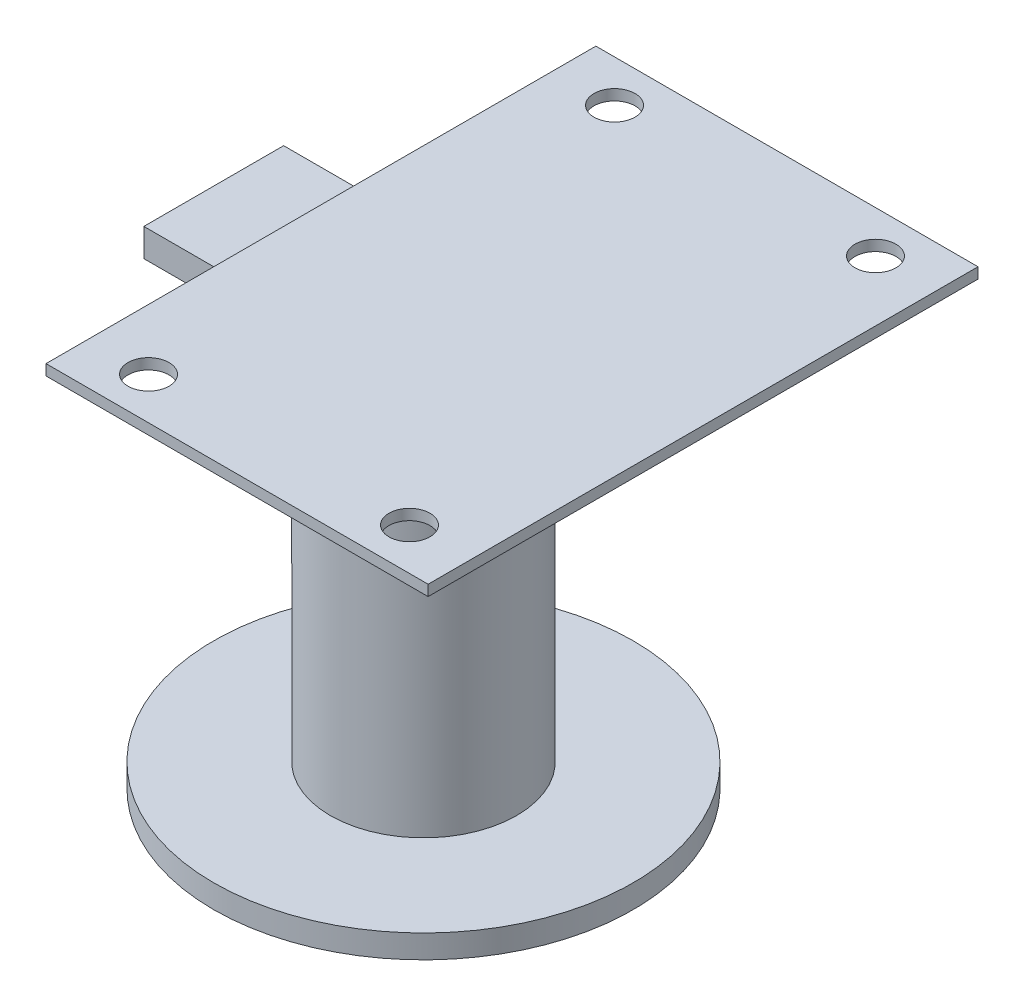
ISO-10303-21;
HEADER;
FILE_DESCRIPTION(('STEP AP214'),'2;1');
FILE_NAME('part.step','',(''),(''),'','','');
FILE_SCHEMA(('AUTOMOTIVE_DESIGN { 1 0 10303 214 1 1 1 1 }'));
ENDSEC;
DATA;
#1=APPLICATION_CONTEXT('core data for automotive mechanical design processes');
#2=APPLICATION_PROTOCOL_DEFINITION('international standard','automotive_design',2000,#1);
#3=PRODUCT_CONTEXT('',#1,'mechanical');
#4=PRODUCT('Part','Part','',(#3));
#5=PRODUCT_RELATED_PRODUCT_CATEGORY('part','',(#4));
#6=PRODUCT_DEFINITION_FORMATION('','',#4);
#7=PRODUCT_DEFINITION_CONTEXT('part definition',#1,'design');
#8=PRODUCT_DEFINITION('design','',#6,#7);
#9=PRODUCT_DEFINITION_SHAPE('','',#8);
#10=(LENGTH_UNIT() NAMED_UNIT(*) SI_UNIT(.MILLI.,.METRE.));
#11=(NAMED_UNIT(*) PLANE_ANGLE_UNIT() SI_UNIT($,.RADIAN.));
#12=(NAMED_UNIT(*) SI_UNIT($,.STERADIAN.) SOLID_ANGLE_UNIT());
#13=UNCERTAINTY_MEASURE_WITH_UNIT(LENGTH_MEASURE(1.E-05),#10,'distance_accuracy_value','');
#14=(GEOMETRIC_REPRESENTATION_CONTEXT(3) GLOBAL_UNCERTAINTY_ASSIGNED_CONTEXT((#13)) GLOBAL_UNIT_ASSIGNED_CONTEXT((#10,
#11,#12)) REPRESENTATION_CONTEXT('',''));
#15=CARTESIAN_POINT('',(0.,0.,0.));
#16=DIRECTION('',(0.,0.,1.));
#17=DIRECTION('',(1.,0.,0.));
#18=AXIS2_PLACEMENT_3D('',#15,#16,#17);
#19=CARTESIAN_POINT('',(41.,-2.3,59.));
#20=DIRECTION('',(1.,0.,0.));
#21=DIRECTION('',(0.,0.,-1.));
#22=AXIS2_PLACEMENT_3D('',#19,#20,#21);
#23=PLANE('',#22);
#24=DIRECTION('',(0.,0.,-1.));
#25=VECTOR('',#24,1.);
#26=CARTESIAN_POINT('',(41.,0.,59.));
#27=LINE('',#26,#25);
#28=CARTESIAN_POINT('',(41.,0.,59.));
#29=VERTEX_POINT('',#28);
#30=CARTESIAN_POINT('',(41.,0.,-59.));
#31=VERTEX_POINT('',#30);
#32=EDGE_CURVE('E186',#29,#31,#27,.T.);
#33=ORIENTED_EDGE('',*,*,#32,.F.);
#34=DIRECTION('',(0.,1.,0.));
#35=VECTOR('',#34,1.);
#36=CARTESIAN_POINT('',(41.,-2.3,59.));
#37=LINE('',#36,#35);
#38=CARTESIAN_POINT('',(41.,-2.3,59.));
#39=VERTEX_POINT('',#38);
#40=EDGE_CURVE('E174',#39,#29,#37,.T.);
#41=ORIENTED_EDGE('',*,*,#40,.F.);
#42=DIRECTION('',(0.,0.,-1.));
#43=VECTOR('',#42,1.);
#44=CARTESIAN_POINT('',(41.,-2.3,59.));
#45=LINE('',#44,#43);
#46=CARTESIAN_POINT('',(41.,-2.3,-59.));
#47=VERTEX_POINT('',#46);
#48=EDGE_CURVE('E169',#39,#47,#45,.T.);
#49=ORIENTED_EDGE('',*,*,#48,.T.);
#50=DIRECTION('',(0.,1.,0.));
#51=VECTOR('',#50,1.);
#52=CARTESIAN_POINT('',(41.,-2.3,-59.));
#53=LINE('',#52,#51);
#54=EDGE_CURVE('E151',#47,#31,#53,.T.);
#55=ORIENTED_EDGE('',*,*,#54,.T.);
#56=EDGE_LOOP('',(#33,#41,#49,#55));
#57=FACE_BOUND('',#56,.T.);
#58=ADVANCED_FACE('F40',(#57),#23,.T.);
#59=CARTESIAN_POINT('',(-41.,-2.3,59.));
#60=DIRECTION('',(0.,0.,1.));
#61=DIRECTION('',(1.,0.,0.));
#62=AXIS2_PLACEMENT_3D('',#59,#60,#61);
#63=PLANE('',#62);
#64=DIRECTION('',(1.,0.,0.));
#65=VECTOR('',#64,1.);
#66=CARTESIAN_POINT('',(-41.,0.,59.));
#67=LINE('',#66,#65);
#68=CARTESIAN_POINT('',(-41.,0.,59.));
#69=VERTEX_POINT('',#68);
#70=EDGE_CURVE('E175',#69,#29,#67,.T.);
#71=ORIENTED_EDGE('',*,*,#70,.F.);
#72=DIRECTION('',(0.,1.,0.));
#73=VECTOR('',#72,1.);
#74=CARTESIAN_POINT('',(-41.,-2.3,59.));
#75=LINE('',#74,#73);
#76=CARTESIAN_POINT('',(-41.,-2.3,59.));
#77=VERTEX_POINT('',#76);
#78=EDGE_CURVE('E193',#77,#69,#75,.T.);
#79=ORIENTED_EDGE('',*,*,#78,.F.);
#80=DIRECTION('',(1.,0.,0.));
#81=VECTOR('',#80,1.);
#82=CARTESIAN_POINT('',(-41.,-2.3,59.));
#83=LINE('',#82,#81);
#84=EDGE_CURVE('E162',#77,#39,#83,.T.);
#85=ORIENTED_EDGE('',*,*,#84,.T.);
#86=ORIENTED_EDGE('',*,*,#40,.T.);
#87=EDGE_LOOP('',(#71,#79,#85,#86));
#88=FACE_BOUND('',#87,.T.);
#89=ADVANCED_FACE('F308',(#88),#63,.T.);
#90=CARTESIAN_POINT('',(-41.,-2.3,59.));
#91=DIRECTION('',(-1.,0.,0.));
#92=DIRECTION('',(0.,0.,1.));
#93=AXIS2_PLACEMENT_3D('',#90,#91,#92);
#94=PLANE('',#93);
#95=DIRECTION('',(0.,0.,1.));
#96=VECTOR('',#95,1.);
#97=CARTESIAN_POINT('',(-41.,0.,59.));
#98=LINE('',#97,#96);
#99=CARTESIAN_POINT('',(-41.,0.,-59.));
#100=VERTEX_POINT('',#99);
#101=EDGE_CURVE('E178',#100,#69,#98,.T.);
#102=ORIENTED_EDGE('',*,*,#101,.F.);
#103=DIRECTION('',(0.,1.,0.));
#104=VECTOR('',#103,1.);
#105=CARTESIAN_POINT('',(-41.,-2.3,-59.));
#106=LINE('',#105,#104);
#107=CARTESIAN_POINT('',(-41.,-2.3,-59.));
#108=VERTEX_POINT('',#107);
#109=EDGE_CURVE('E161',#108,#100,#106,.T.);
#110=ORIENTED_EDGE('',*,*,#109,.F.);
#111=DIRECTION('',(0.,0.,1.));
#112=VECTOR('',#111,1.);
#113=CARTESIAN_POINT('',(-41.,-2.3,59.));
#114=LINE('',#113,#112);
#115=EDGE_CURVE('E172',#108,#77,#114,.T.);
#116=ORIENTED_EDGE('',*,*,#115,.T.);
#117=ORIENTED_EDGE('',*,*,#78,.T.);
#118=EDGE_LOOP('',(#102,#110,#116,#117));
#119=FACE_BOUND('',#118,.T.);
#120=ADVANCED_FACE('F313',(#119),#94,.T.);
#121=CARTESIAN_POINT('',(-41.,-2.3,-59.));
#122=DIRECTION('',(0.,0.,-1.));
#123=DIRECTION('',(-1.,0.,0.));
#124=AXIS2_PLACEMENT_3D('',#121,#122,#123);
#125=PLANE('',#124);
#126=DIRECTION('',(-1.,0.,0.));
#127=VECTOR('',#126,1.);
#128=CARTESIAN_POINT('',(-41.,0.,-59.));
#129=LINE('',#128,#127);
#130=EDGE_CURVE('E156',#31,#100,#129,.T.);
#131=ORIENTED_EDGE('',*,*,#130,.F.);
#132=ORIENTED_EDGE('',*,*,#54,.F.);
#133=DIRECTION('',(-1.,0.,0.));
#134=VECTOR('',#133,1.);
#135=CARTESIAN_POINT('',(-41.,-2.3,-59.));
#136=LINE('',#135,#134);
#137=EDGE_CURVE('E154',#47,#108,#136,.T.);
#138=ORIENTED_EDGE('',*,*,#137,.T.);
#139=ORIENTED_EDGE('',*,*,#109,.T.);
#140=EDGE_LOOP('',(#131,#132,#138,#139));
#141=FACE_BOUND('',#140,.T.);
#142=ADVANCED_FACE('F153',(#141),#125,.T.);
#143=CARTESIAN_POINT('',(0.,-2.3,0.));
#144=DIRECTION('',(0.,-1.,0.));
#145=DIRECTION('',(0.,0.,-1.));
#146=AXIS2_PLACEMENT_3D('',#143,#144,#145);
#147=PLANE('',#146);
#148=CARTESIAN_POINT('',(-19.,-2.3,0.));
#149=DIRECTION('',(0.,-1.,0.));
#150=DIRECTION('',(0.,0.,-1.));
#151=AXIS2_PLACEMENT_3D('',#148,#149,#150);
#152=CIRCLE('',#151,20.);
#153=CARTESIAN_POINT('',(-19.,-2.3,-20.));
#154=VERTEX_POINT('',#153);
#155=EDGE_CURVE('E539',#154,#154,#152,.T.);
#156=ORIENTED_EDGE('',*,*,#155,.F.);
#157=EDGE_LOOP('',(#156));
#158=FACE_BOUND('',#157,.T.);
#159=CARTESIAN_POINT('',(28.,-2.3,-50.));
#160=DIRECTION('',(0.,1.,0.));
#161=DIRECTION('',(0.,0.,1.));
#162=AXIS2_PLACEMENT_3D('',#159,#160,#161);
#163=CIRCLE('',#162,4.4);
#164=CARTESIAN_POINT('',(28.,-2.3,-45.6));
#165=VERTEX_POINT('',#164);
#166=EDGE_CURVE('E543',#165,#165,#163,.T.);
#167=ORIENTED_EDGE('',*,*,#166,.T.);
#168=EDGE_LOOP('',(#167));
#169=FACE_BOUND('',#168,.T.);
#170=CARTESIAN_POINT('',(28.,-2.3,50.));
#171=DIRECTION('',(0.,1.,0.));
#172=DIRECTION('',(0.,0.,1.));
#173=AXIS2_PLACEMENT_3D('',#170,#171,#172);
#174=CIRCLE('',#173,4.4);
#175=CARTESIAN_POINT('',(28.,-2.3,54.4));
#176=VERTEX_POINT('',#175);
#177=EDGE_CURVE('E547',#176,#176,#174,.T.);
#178=ORIENTED_EDGE('',*,*,#177,.T.);
#179=EDGE_LOOP('',(#178));
#180=FACE_BOUND('',#179,.T.);
#181=CARTESIAN_POINT('',(-28.,-2.3,50.));
#182=DIRECTION('',(0.,1.,0.));
#183=DIRECTION('',(0.,0.,1.));
#184=AXIS2_PLACEMENT_3D('',#181,#182,#183);
#185=CIRCLE('',#184,4.4);
#186=CARTESIAN_POINT('',(-28.,-2.3,54.4));
#187=VERTEX_POINT('',#186);
#188=EDGE_CURVE('E551',#187,#187,#185,.T.);
#189=ORIENTED_EDGE('',*,*,#188,.T.);
#190=EDGE_LOOP('',(#189));
#191=FACE_BOUND('',#190,.T.);
#192=CARTESIAN_POINT('',(-28.,-2.3,-50.));
#193=DIRECTION('',(0.,1.,0.));
#194=DIRECTION('',(0.,0.,1.));
#195=AXIS2_PLACEMENT_3D('',#192,#193,#194);
#196=CIRCLE('',#195,4.4);
#197=CARTESIAN_POINT('',(-28.,-2.3,-45.6));
#198=VERTEX_POINT('',#197);
#199=EDGE_CURVE('E188',#198,#198,#196,.T.);
#200=ORIENTED_EDGE('',*,*,#199,.T.);
#201=EDGE_LOOP('',(#200));
#202=FACE_BOUND('',#201,.T.);
#203=ORIENTED_EDGE('',*,*,#48,.F.);
#204=ORIENTED_EDGE('',*,*,#84,.F.);
#205=ORIENTED_EDGE('',*,*,#115,.F.);
#206=ORIENTED_EDGE('',*,*,#137,.F.);
#207=EDGE_LOOP('',(#203,#204,#205,#206));
#208=FACE_BOUND('',#207,.T.);
#209=ADVANCED_FACE('F167',(#158,#169,#180,#191,#202,#208),#147,.T.);
#210=CARTESIAN_POINT('',(0.,0.,0.));
#211=DIRECTION('',(0.,-1.,0.));
#212=DIRECTION('',(0.,0.,-1.));
#213=AXIS2_PLACEMENT_3D('',#210,#211,#212);
#214=PLANE('',#213);
#215=CARTESIAN_POINT('',(28.,0.,-50.));
#216=DIRECTION('',(0.,1.,0.));
#217=DIRECTION('',(0.,0.,1.));
#218=AXIS2_PLACEMENT_3D('',#215,#216,#217);
#219=CIRCLE('',#218,4.4);
#220=CARTESIAN_POINT('',(28.,0.,-45.6));
#221=VERTEX_POINT('',#220);
#222=EDGE_CURVE('E564',#221,#221,#219,.T.);
#223=ORIENTED_EDGE('',*,*,#222,.F.);
#224=EDGE_LOOP('',(#223));
#225=FACE_BOUND('',#224,.T.);
#226=CARTESIAN_POINT('',(28.,0.,50.));
#227=DIRECTION('',(0.,1.,0.));
#228=DIRECTION('',(0.,0.,1.));
#229=AXIS2_PLACEMENT_3D('',#226,#227,#228);
#230=CIRCLE('',#229,4.4);
#231=CARTESIAN_POINT('',(28.,0.,54.4));
#232=VERTEX_POINT('',#231);
#233=EDGE_CURVE('E560',#232,#232,#230,.T.);
#234=ORIENTED_EDGE('',*,*,#233,.F.);
#235=EDGE_LOOP('',(#234));
#236=FACE_BOUND('',#235,.T.);
#237=CARTESIAN_POINT('',(-28.,0.,50.));
#238=DIRECTION('',(0.,1.,0.));
#239=DIRECTION('',(0.,0.,1.));
#240=AXIS2_PLACEMENT_3D('',#237,#238,#239);
#241=CIRCLE('',#240,4.4);
#242=CARTESIAN_POINT('',(-28.,0.,54.4));
#243=VERTEX_POINT('',#242);
#244=EDGE_CURVE('E556',#243,#243,#241,.T.);
#245=ORIENTED_EDGE('',*,*,#244,.F.);
#246=EDGE_LOOP('',(#245));
#247=FACE_BOUND('',#246,.T.);
#248=CARTESIAN_POINT('',(-28.,0.,-50.));
#249=DIRECTION('',(0.,1.,0.));
#250=DIRECTION('',(0.,0.,1.));
#251=AXIS2_PLACEMENT_3D('',#248,#249,#250);
#252=CIRCLE('',#251,4.4);
#253=CARTESIAN_POINT('',(-28.,0.,-45.6));
#254=VERTEX_POINT('',#253);
#255=EDGE_CURVE('E181',#254,#254,#252,.T.);
#256=ORIENTED_EDGE('',*,*,#255,.F.);
#257=EDGE_LOOP('',(#256));
#258=FACE_BOUND('',#257,.T.);
#259=ORIENTED_EDGE('',*,*,#32,.T.);
#260=ORIENTED_EDGE('',*,*,#130,.T.);
#261=ORIENTED_EDGE('',*,*,#101,.T.);
#262=ORIENTED_EDGE('',*,*,#70,.T.);
#263=EDGE_LOOP('',(#259,#260,#261,#262));
#264=FACE_BOUND('',#263,.T.);
#265=ADVANCED_FACE('F470',(#225,#236,#247,#258,#264),#214,.F.);
#266=CARTESIAN_POINT('',(-28.,-2.3,-50.));
#267=DIRECTION('',(0.,1.,0.));
#268=DIRECTION('',(0.,0.,1.));
#269=AXIS2_PLACEMENT_3D('',#266,#267,#268);
#270=CYLINDRICAL_SURFACE('',#269,4.4);
#271=ORIENTED_EDGE('',*,*,#199,.F.);
#272=EDGE_LOOP('',(#271));
#273=FACE_BOUND('',#272,.T.);
#274=ORIENTED_EDGE('',*,*,#255,.T.);
#275=EDGE_LOOP('',(#274));
#276=FACE_BOUND('',#275,.T.);
#277=ADVANCED_FACE('F460',(#273,#276),#270,.F.);
#278=CARTESIAN_POINT('',(-28.,-2.3,50.));
#279=DIRECTION('',(0.,1.,0.));
#280=DIRECTION('',(0.,0.,1.));
#281=AXIS2_PLACEMENT_3D('',#278,#279,#280);
#282=CYLINDRICAL_SURFACE('',#281,4.4);
#283=ORIENTED_EDGE('',*,*,#188,.F.);
#284=EDGE_LOOP('',(#283));
#285=FACE_BOUND('',#284,.T.);
#286=ORIENTED_EDGE('',*,*,#244,.T.);
#287=EDGE_LOOP('',(#286));
#288=FACE_BOUND('',#287,.T.);
#289=ADVANCED_FACE('F450',(#285,#288),#282,.F.);
#290=CARTESIAN_POINT('',(28.,-2.3,50.));
#291=DIRECTION('',(0.,1.,0.));
#292=DIRECTION('',(0.,0.,1.));
#293=AXIS2_PLACEMENT_3D('',#290,#291,#292);
#294=CYLINDRICAL_SURFACE('',#293,4.4);
#295=ORIENTED_EDGE('',*,*,#177,.F.);
#296=EDGE_LOOP('',(#295));
#297=FACE_BOUND('',#296,.T.);
#298=ORIENTED_EDGE('',*,*,#233,.T.);
#299=EDGE_LOOP('',(#298));
#300=FACE_BOUND('',#299,.T.);
#301=ADVANCED_FACE('F440',(#297,#300),#294,.F.);
#302=CARTESIAN_POINT('',(28.,-2.3,-50.));
#303=DIRECTION('',(0.,1.,0.));
#304=DIRECTION('',(0.,0.,1.));
#305=AXIS2_PLACEMENT_3D('',#302,#303,#304);
#306=CYLINDRICAL_SURFACE('',#305,4.4);
#307=ORIENTED_EDGE('',*,*,#166,.F.);
#308=EDGE_LOOP('',(#307));
#309=FACE_BOUND('',#308,.T.);
#310=ORIENTED_EDGE('',*,*,#222,.T.);
#311=EDGE_LOOP('',(#310));
#312=FACE_BOUND('',#311,.T.);
#313=ADVANCED_FACE('F431',(#309,#312),#306,.F.);
#314=CARTESIAN_POINT('',(-19.,-154.068542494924,0.));
#315=DIRECTION('',(0.,1.,0.));
#316=DIRECTION('',(0.,0.,1.));
#317=AXIS2_PLACEMENT_3D('',#314,#315,#316);
#318=CYLINDRICAL_SURFACE('',#317,20.);
#319=DIRECTION('',(0.,1.,0.));
#320=VECTOR('',#319,1.);
#321=CARTESIAN_POINT('',(-32.228756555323,-154.068542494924,15.));
#322=LINE('',#321,#320);
#323=CARTESIAN_POINT('',(-32.228756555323,-33.0074092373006,15.));
#324=VERTEX_POINT('',#323);
#325=CARTESIAN_POINT('',(-32.228756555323,-8.00000000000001,15.));
#326=VERTEX_POINT('',#325);
#327=EDGE_CURVE('E206',#324,#326,#322,.T.);
#328=ORIENTED_EDGE('',*,*,#327,.F.);
#329=CARTESIAN_POINT('',(-19.,-48.,0.));
#330=DIRECTION('',(0.749837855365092,0.661621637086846,0.));
#331=DIRECTION('',(-0.661621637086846,0.749837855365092,0.));
#332=AXIS2_PLACEMENT_3D('',#329,#330,#331);
#333=ELLIPSE('',#332,30.2287574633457,20.);
#334=CARTESIAN_POINT('',(-33.2828568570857,-31.8127622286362,14.));
#335=VERTEX_POINT('',#334);
#336=EDGE_CURVE('E200',#324,#335,#333,.F.);
#337=ORIENTED_EDGE('',*,*,#336,.T.);
#338=DIRECTION('',(0.,1.,0.));
#339=VECTOR('',#338,1.);
#340=CARTESIAN_POINT('',(-33.2828568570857,-154.068542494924,14.));
#341=LINE('',#340,#339);
#342=CARTESIAN_POINT('',(-33.2828568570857,-9.00000000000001,14.));
#343=VERTEX_POINT('',#342);
#344=EDGE_CURVE('E199',#335,#343,#341,.T.);
#345=ORIENTED_EDGE('',*,*,#344,.T.);
#346=CARTESIAN_POINT('',(-19.,-9.00000000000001,0.));
#347=DIRECTION('',(0.,-1.,0.));
#348=DIRECTION('',(1.,0.,0.));
#349=AXIS2_PLACEMENT_3D('',#346,#347,#348);
#350=CIRCLE('',#349,20.);
#351=CARTESIAN_POINT('',(-33.2828568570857,-9.00000000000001,-14.));
#352=VERTEX_POINT('',#351);
#353=EDGE_CURVE('E55',#352,#343,#350,.F.);
#354=ORIENTED_EDGE('',*,*,#353,.F.);
#355=DIRECTION('',(0.,1.,0.));
#356=VECTOR('',#355,1.);
#357=CARTESIAN_POINT('',(-33.2828568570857,-154.068542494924,-14.));
#358=LINE('',#357,#356);
#359=CARTESIAN_POINT('',(-33.2828568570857,-31.8127622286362,-14.));
#360=VERTEX_POINT('',#359);
#361=EDGE_CURVE('E12',#360,#352,#358,.T.);
#362=ORIENTED_EDGE('',*,*,#361,.F.);
#363=CARTESIAN_POINT('',(-32.228756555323,-33.0074092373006,-15.));
#364=VERTEX_POINT('',#363);
#365=EDGE_CURVE('E197',#360,#364,#333,.F.);
#366=ORIENTED_EDGE('',*,*,#365,.T.);
#367=DIRECTION('',(0.,1.,0.));
#368=VECTOR('',#367,1.);
#369=CARTESIAN_POINT('',(-32.228756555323,-154.068542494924,-15.));
#370=LINE('',#369,#368);
#371=CARTESIAN_POINT('',(-32.228756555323,-8.00000000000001,-15.));
#372=VERTEX_POINT('',#371);
#373=EDGE_CURVE('E202',#364,#372,#370,.T.);
#374=ORIENTED_EDGE('',*,*,#373,.T.);
#375=CARTESIAN_POINT('',(-19.,-8.00000000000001,0.));
#376=DIRECTION('',(0.,-1.,0.));
#377=DIRECTION('',(1.,0.,0.));
#378=AXIS2_PLACEMENT_3D('',#375,#376,#377);
#379=CIRCLE('',#378,20.);
#380=EDGE_CURVE('E204',#372,#326,#379,.F.);
#381=ORIENTED_EDGE('',*,*,#380,.T.);
#382=EDGE_LOOP('',(#328,#337,#345,#354,#362,#366,#374,#381));
#383=FACE_BOUND('',#382,.T.);
#384=CARTESIAN_POINT('',(-19.,-92.5,0.));
#385=DIRECTION('',(0.,-1.,0.));
#386=DIRECTION('',(0.,0.,-1.));
#387=AXIS2_PLACEMENT_3D('',#384,#385,#386);
#388=CIRCLE('',#387,20.);
#389=CARTESIAN_POINT('',(-19.,-92.5,-20.));
#390=VERTEX_POINT('',#389);
#391=EDGE_CURVE('E569',#390,#390,#388,.T.);
#392=ORIENTED_EDGE('',*,*,#391,.F.);
#393=EDGE_LOOP('',(#392));
#394=FACE_BOUND('',#393,.T.);
#395=ORIENTED_EDGE('',*,*,#155,.T.);
#396=EDGE_LOOP('',(#395));
#397=FACE_BOUND('',#396,.T.);
#398=ADVANCED_FACE('F289',(#383,#394,#397),#318,.T.);
#399=CARTESIAN_POINT('',(-19.,-92.5,0.));
#400=DIRECTION('',(0.,-1.,0.));
#401=DIRECTION('',(0.,0.,-1.));
#402=AXIS2_PLACEMENT_3D('',#399,#400,#401);
#403=PLANE('',#402);
#404=ORIENTED_EDGE('',*,*,#391,.T.);
#405=EDGE_LOOP('',(#404));
#406=FACE_BOUND('',#405,.T.);
#407=CARTESIAN_POINT('',(-19.,-92.5,0.));
#408=DIRECTION('',(0.,-1.,0.));
#409=DIRECTION('',(0.,0.,-1.));
#410=AXIS2_PLACEMENT_3D('',#407,#408,#409);
#411=CIRCLE('',#410,45.);
#412=CARTESIAN_POINT('',(-19.,-92.5,-45.));
#413=VERTEX_POINT('',#412);
#414=EDGE_CURVE('E575',#413,#413,#411,.T.);
#415=ORIENTED_EDGE('',*,*,#414,.F.);
#416=EDGE_LOOP('',(#415));
#417=FACE_BOUND('',#416,.T.);
#418=ADVANCED_FACE('F412',(#406,#417),#403,.F.);
#419=CARTESIAN_POINT('',(-19.,-224.779220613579,0.));
#420=DIRECTION('',(0.,1.,0.));
#421=DIRECTION('',(0.,0.,1.));
#422=AXIS2_PLACEMENT_3D('',#419,#420,#421);
#423=CYLINDRICAL_SURFACE('',#422,45.);
#424=CARTESIAN_POINT('',(-19.,-97.5,0.));
#425=DIRECTION('',(0.,1.,0.));
#426=DIRECTION('',(0.,0.,1.));
#427=AXIS2_PLACEMENT_3D('',#424,#425,#426);
#428=CIRCLE('',#427,45.);
#429=CARTESIAN_POINT('',(-19.,-97.5,45.));
#430=VERTEX_POINT('',#429);
#431=EDGE_CURVE('E572',#430,#430,#428,.T.);
#432=ORIENTED_EDGE('',*,*,#431,.T.);
#433=EDGE_LOOP('',(#432));
#434=FACE_BOUND('',#433,.T.);
#435=ORIENTED_EDGE('',*,*,#414,.T.);
#436=EDGE_LOOP('',(#435));
#437=FACE_BOUND('',#436,.T.);
#438=ADVANCED_FACE('F301',(#434,#437),#423,.T.);
#439=CARTESIAN_POINT('',(0.,-97.5,0.));
#440=DIRECTION('',(0.,1.,0.));
#441=DIRECTION('',(0.,0.,1.));
#442=AXIS2_PLACEMENT_3D('',#439,#440,#441);
#443=PLANE('',#442);
#444=ORIENTED_EDGE('',*,*,#431,.F.);
#445=EDGE_LOOP('',(#444));
#446=FACE_BOUND('',#445,.T.);
#447=ADVANCED_FACE('F294',(#446),#443,.F.);
#448=CARTESIAN_POINT('',(-49.,-14.,15.));
#449=DIRECTION('',(0.749837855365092,0.661621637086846,0.));
#450=DIRECTION('',(-0.661621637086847,0.749837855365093,0.));
#451=AXIS2_PLACEMENT_3D('',#448,#449,#450);
#452=PLANE('',#451);
#453=ORIENTED_EDGE('',*,*,#365,.F.);
#454=DIRECTION('',(0.661621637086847,-0.749837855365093,0.));
#455=VECTOR('',#454,1.);
#456=CARTESIAN_POINT('',(-49.,-14.,-14.));
#457=LINE('',#456,#455);
#458=CARTESIAN_POINT('',(-49.,-14.,-14.));
#459=VERTEX_POINT('',#458);
#460=EDGE_CURVE('E214',#459,#360,#457,.T.);
#461=ORIENTED_EDGE('',*,*,#460,.F.);
#462=DIRECTION('',(0.,0.,-1.));
#463=VECTOR('',#462,1.);
#464=CARTESIAN_POINT('',(-49.,-14.,15.));
#465=LINE('',#464,#463);
#466=CARTESIAN_POINT('',(-49.,-14.,-15.));
#467=VERTEX_POINT('',#466);
#468=EDGE_CURVE('E81',#459,#467,#465,.T.);
#469=ORIENTED_EDGE('',*,*,#468,.T.);
#470=DIRECTION('',(0.661621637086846,-0.749837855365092,0.));
#471=VECTOR('',#470,1.);
#472=CARTESIAN_POINT('',(-49.,-14.,-15.));
#473=LINE('',#472,#471);
#474=EDGE_CURVE('E234',#467,#364,#473,.T.);
#475=ORIENTED_EDGE('',*,*,#474,.T.);
#476=EDGE_LOOP('',(#453,#461,#469,#475));
#477=FACE_BOUND('',#476,.T.);
#478=ADVANCED_FACE('F292',(#477),#452,.F.);
#479=CARTESIAN_POINT('',(0.,0.,15.));
#480=DIRECTION('',(0.,0.,1.));
#481=DIRECTION('',(1.,0.,0.));
#482=AXIS2_PLACEMENT_3D('',#479,#480,#481);
#483=PLANE('',#482);
#484=DIRECTION('',(0.661621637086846,-0.749837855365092,0.));
#485=VECTOR('',#484,1.);
#486=CARTESIAN_POINT('',(-49.,-14.,15.));
#487=LINE('',#486,#485);
#488=CARTESIAN_POINT('',(-49.,-14.,15.));
#489=VERTEX_POINT('',#488);
#490=EDGE_CURVE('E237',#489,#324,#487,.T.);
#491=ORIENTED_EDGE('',*,*,#490,.T.);
#492=ORIENTED_EDGE('',*,*,#327,.T.);
#493=DIRECTION('',(-1.,0.,0.));
#494=VECTOR('',#493,1.);
#495=CARTESIAN_POINT('',(-19.,-8.,15.));
#496=LINE('',#495,#494);
#497=CARTESIAN_POINT('',(-64.,-8.00000000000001,15.));
#498=VERTEX_POINT('',#497);
#499=EDGE_CURVE('E86',#326,#498,#496,.T.);
#500=ORIENTED_EDGE('',*,*,#499,.T.);
#501=DIRECTION('',(0.,-1.,0.));
#502=VECTOR('',#501,1.);
#503=CARTESIAN_POINT('',(-64.,-8.00000000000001,15.));
#504=LINE('',#503,#502);
#505=CARTESIAN_POINT('',(-64.,-14.,15.));
#506=VERTEX_POINT('',#505);
#507=EDGE_CURVE('E233',#498,#506,#504,.T.);
#508=ORIENTED_EDGE('',*,*,#507,.T.);
#509=DIRECTION('',(1.,0.,0.));
#510=VECTOR('',#509,1.);
#511=CARTESIAN_POINT('',(-64.,-14.,15.));
#512=LINE('',#511,#510);
#513=EDGE_CURVE('E63',#506,#489,#512,.T.);
#514=ORIENTED_EDGE('',*,*,#513,.T.);
#515=EDGE_LOOP('',(#491,#492,#500,#508,#514));
#516=FACE_BOUND('',#515,.T.);
#517=ADVANCED_FACE('F287',(#516),#483,.T.);
#518=CARTESIAN_POINT('',(0.,0.,-15.));
#519=DIRECTION('',(0.,0.,1.));
#520=DIRECTION('',(1.,0.,0.));
#521=AXIS2_PLACEMENT_3D('',#518,#519,#520);
#522=PLANE('',#521);
#523=ORIENTED_EDGE('',*,*,#373,.F.);
#524=ORIENTED_EDGE('',*,*,#474,.F.);
#525=DIRECTION('',(1.,0.,0.));
#526=VECTOR('',#525,1.);
#527=CARTESIAN_POINT('',(-64.,-14.,-15.));
#528=LINE('',#527,#526);
#529=CARTESIAN_POINT('',(-64.,-14.,-15.));
#530=VERTEX_POINT('',#529);
#531=EDGE_CURVE('E243',#530,#467,#528,.T.);
#532=ORIENTED_EDGE('',*,*,#531,.F.);
#533=DIRECTION('',(0.,-1.,0.));
#534=VECTOR('',#533,1.);
#535=CARTESIAN_POINT('',(-64.,-8.00000000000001,-15.));
#536=LINE('',#535,#534);
#537=CARTESIAN_POINT('',(-64.,-8.00000000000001,-15.));
#538=VERTEX_POINT('',#537);
#539=EDGE_CURVE('E240',#538,#530,#536,.T.);
#540=ORIENTED_EDGE('',*,*,#539,.F.);
#541=DIRECTION('',(-1.,0.,0.));
#542=VECTOR('',#541,1.);
#543=CARTESIAN_POINT('',(-39.,-8.00000000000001,-15.));
#544=LINE('',#543,#542);
#545=EDGE_CURVE('E218',#372,#538,#544,.T.);
#546=ORIENTED_EDGE('',*,*,#545,.F.);
#547=EDGE_LOOP('',(#523,#524,#532,#540,#546));
#548=FACE_BOUND('',#547,.T.);
#549=ADVANCED_FACE('F265',(#548),#522,.F.);
#550=CARTESIAN_POINT('',(0.,0.,14.));
#551=DIRECTION('',(0.,0.,1.));
#552=DIRECTION('',(1.,0.,0.));
#553=AXIS2_PLACEMENT_3D('',#550,#551,#552);
#554=PLANE('',#553);
#555=ORIENTED_EDGE('',*,*,#344,.F.);
#556=DIRECTION('',(0.661621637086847,-0.749837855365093,0.));
#557=VECTOR('',#556,1.);
#558=CARTESIAN_POINT('',(-49.,-14.,14.));
#559=LINE('',#558,#557);
#560=CARTESIAN_POINT('',(-49.,-14.,14.));
#561=VERTEX_POINT('',#560);
#562=EDGE_CURVE('E219',#561,#335,#559,.T.);
#563=ORIENTED_EDGE('',*,*,#562,.F.);
#564=DIRECTION('',(1.,0.,0.));
#565=VECTOR('',#564,1.);
#566=CARTESIAN_POINT('',(-64.,-14.,14.));
#567=LINE('',#566,#565);
#568=CARTESIAN_POINT('',(-64.,-14.,14.));
#569=VERTEX_POINT('',#568);
#570=EDGE_CURVE('E227',#569,#561,#567,.T.);
#571=ORIENTED_EDGE('',*,*,#570,.F.);
#572=DIRECTION('',(0.,-1.,0.));
#573=VECTOR('',#572,1.);
#574=CARTESIAN_POINT('',(-64.,-8.00000000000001,14.));
#575=LINE('',#574,#573);
#576=CARTESIAN_POINT('',(-64.,-9.00000000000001,14.));
#577=VERTEX_POINT('',#576);
#578=EDGE_CURVE('E213',#577,#569,#575,.T.);
#579=ORIENTED_EDGE('',*,*,#578,.F.);
#580=DIRECTION('',(-1.,0.,0.));
#581=VECTOR('',#580,1.);
#582=CARTESIAN_POINT('',(-39.,-9.00000000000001,14.));
#583=LINE('',#582,#581);
#584=EDGE_CURVE('E211',#343,#577,#583,.T.);
#585=ORIENTED_EDGE('',*,*,#584,.F.);
#586=EDGE_LOOP('',(#555,#563,#571,#579,#585));
#587=FACE_BOUND('',#586,.T.);
#588=ADVANCED_FACE('F280',(#587),#554,.F.);
#589=CARTESIAN_POINT('',(0.,0.,-14.));
#590=DIRECTION('',(0.,0.,1.));
#591=DIRECTION('',(1.,0.,0.));
#592=AXIS2_PLACEMENT_3D('',#589,#590,#591);
#593=PLANE('',#592);
#594=ORIENTED_EDGE('',*,*,#460,.T.);
#595=ORIENTED_EDGE('',*,*,#361,.T.);
#596=DIRECTION('',(-1.,0.,0.));
#597=VECTOR('',#596,1.);
#598=CARTESIAN_POINT('',(-39.,-9.00000000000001,-14.));
#599=LINE('',#598,#597);
#600=CARTESIAN_POINT('',(-64.,-9.00000000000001,-14.));
#601=VERTEX_POINT('',#600);
#602=EDGE_CURVE('E208',#352,#601,#599,.T.);
#603=ORIENTED_EDGE('',*,*,#602,.T.);
#604=DIRECTION('',(0.,-1.,0.));
#605=VECTOR('',#604,1.);
#606=CARTESIAN_POINT('',(-64.,-8.00000000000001,-14.));
#607=LINE('',#606,#605);
#608=CARTESIAN_POINT('',(-64.,-14.,-14.));
#609=VERTEX_POINT('',#608);
#610=EDGE_CURVE('E210',#601,#609,#607,.T.);
#611=ORIENTED_EDGE('',*,*,#610,.T.);
#612=DIRECTION('',(1.,0.,0.));
#613=VECTOR('',#612,1.);
#614=CARTESIAN_POINT('',(-64.,-14.,-14.));
#615=LINE('',#614,#613);
#616=EDGE_CURVE('E221',#609,#459,#615,.T.);
#617=ORIENTED_EDGE('',*,*,#616,.T.);
#618=EDGE_LOOP('',(#594,#595,#603,#611,#617));
#619=FACE_BOUND('',#618,.T.);
#620=ADVANCED_FACE('F272',(#619),#593,.T.);
#621=CARTESIAN_POINT('',(-64.,-8.00000000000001,15.));
#622=DIRECTION('',(1.,0.,0.));
#623=DIRECTION('',(0.,0.,-1.));
#624=AXIS2_PLACEMENT_3D('',#621,#622,#623);
#625=PLANE('',#624);
#626=ORIENTED_EDGE('',*,*,#610,.F.);
#627=DIRECTION('',(0.,0.,-1.));
#628=VECTOR('',#627,1.);
#629=CARTESIAN_POINT('',(-64.,-9.00000000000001,15.));
#630=LINE('',#629,#628);
#631=EDGE_CURVE('E215',#577,#601,#630,.T.);
#632=ORIENTED_EDGE('',*,*,#631,.F.);
#633=ORIENTED_EDGE('',*,*,#578,.T.);
#634=DIRECTION('',(0.,0.,-1.));
#635=VECTOR('',#634,1.);
#636=CARTESIAN_POINT('',(-64.,-14.,15.));
#637=LINE('',#636,#635);
#638=EDGE_CURVE('E250',#506,#569,#637,.T.);
#639=ORIENTED_EDGE('',*,*,#638,.F.);
#640=ORIENTED_EDGE('',*,*,#507,.F.);
#641=DIRECTION('',(0.,0.,-1.));
#642=VECTOR('',#641,1.);
#643=CARTESIAN_POINT('',(-64.,-8.00000000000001,15.));
#644=LINE('',#643,#642);
#645=EDGE_CURVE('E48',#498,#538,#644,.T.);
#646=ORIENTED_EDGE('',*,*,#645,.T.);
#647=ORIENTED_EDGE('',*,*,#539,.T.);
#648=EDGE_CURVE('E249',#609,#530,#637,.T.);
#649=ORIENTED_EDGE('',*,*,#648,.F.);
#650=EDGE_LOOP('',(#626,#632,#633,#639,#640,#646,#647,#649));
#651=FACE_BOUND('',#650,.T.);
#652=ADVANCED_FACE('F257',(#651),#625,.F.);
#653=CARTESIAN_POINT('',(-64.,-14.,15.));
#654=DIRECTION('',(0.,1.,0.));
#655=DIRECTION('',(-1.,0.,0.));
#656=AXIS2_PLACEMENT_3D('',#653,#654,#655);
#657=PLANE('',#656);
#658=ORIENTED_EDGE('',*,*,#616,.F.);
#659=ORIENTED_EDGE('',*,*,#648,.T.);
#660=ORIENTED_EDGE('',*,*,#531,.T.);
#661=ORIENTED_EDGE('',*,*,#468,.F.);
#662=EDGE_LOOP('',(#658,#659,#660,#661));
#663=FACE_BOUND('',#662,.T.);
#664=ADVANCED_FACE('F269',(#663),#657,.F.);
#665=ORIENTED_EDGE('',*,*,#336,.F.);
#666=ORIENTED_EDGE('',*,*,#490,.F.);
#667=EDGE_CURVE('E246',#489,#561,#465,.T.);
#668=ORIENTED_EDGE('',*,*,#667,.T.);
#669=ORIENTED_EDGE('',*,*,#562,.T.);
#670=EDGE_LOOP('',(#665,#666,#668,#669));
#671=FACE_BOUND('',#670,.T.);
#672=ADVANCED_FACE('F286',(#671),#452,.F.);
#673=CARTESIAN_POINT('',(-39.,-8.00000000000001,15.));
#674=DIRECTION('',(0.,-1.,0.));
#675=DIRECTION('',(1.,0.,0.));
#676=AXIS2_PLACEMENT_3D('',#673,#674,#675);
#677=PLANE('',#676);
#678=ORIENTED_EDGE('',*,*,#380,.F.);
#679=ORIENTED_EDGE('',*,*,#545,.T.);
#680=ORIENTED_EDGE('',*,*,#645,.F.);
#681=ORIENTED_EDGE('',*,*,#499,.F.);
#682=EDGE_LOOP('',(#678,#679,#680,#681));
#683=FACE_BOUND('',#682,.T.);
#684=ADVANCED_FACE('F42',(#683),#677,.F.);
#685=ORIENTED_EDGE('',*,*,#638,.T.);
#686=ORIENTED_EDGE('',*,*,#570,.T.);
#687=ORIENTED_EDGE('',*,*,#667,.F.);
#688=ORIENTED_EDGE('',*,*,#513,.F.);
#689=EDGE_LOOP('',(#685,#686,#687,#688));
#690=FACE_BOUND('',#689,.T.);
#691=ADVANCED_FACE('F282',(#690),#657,.F.);
#692=CARTESIAN_POINT('',(-39.,-9.00000000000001,15.));
#693=DIRECTION('',(0.,-1.,0.));
#694=DIRECTION('',(1.,0.,0.));
#695=AXIS2_PLACEMENT_3D('',#692,#693,#694);
#696=PLANE('',#695);
#697=ORIENTED_EDGE('',*,*,#602,.F.);
#698=ORIENTED_EDGE('',*,*,#353,.T.);
#699=ORIENTED_EDGE('',*,*,#584,.T.);
#700=ORIENTED_EDGE('',*,*,#631,.T.);
#701=EDGE_LOOP('',(#697,#698,#699,#700));
#702=FACE_BOUND('',#701,.T.);
#703=ADVANCED_FACE('F275',(#702),#696,.T.);
#704=CLOSED_SHELL('',(#58,#89,#120,#142,#209,#265,#277,#289,#301,#313,#398,#418,#438,#447,#478,
#517,#549,#588,#620,#652,#664,#672,#684,#691,#703));
#705=MANIFOLD_SOLID_BREP('B2',#704);
#706=ADVANCED_BREP_SHAPE_REPRESENTATION('',(#18,#705),#14);
#707=SHAPE_DEFINITION_REPRESENTATION(#9,#706);
ENDSEC;
END-ISO-10303-21;
